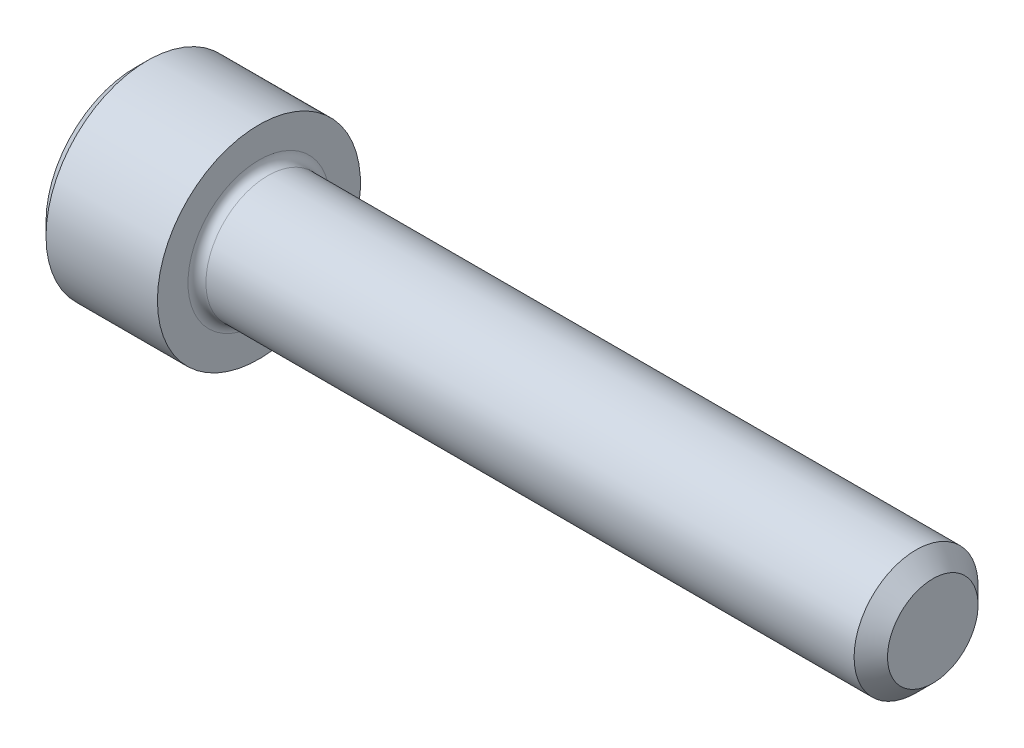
from build123d import *

# Parameters (mm, degrees)
FILLET1_R   = 0.254
HEX_2_DEPTH = 1.6256


with BuildPart() as part:
    # BodySke → Base-Revolve (revolve)
    with BuildSketch(Plane.XY, mode=Mode.PRIVATE) as base_revolve_sk:
        Polygon((0, 0), (0, 2.5146), (0.3556, 2.8702), (3.5052, 2.8702), (3.5052, 1.7526), (22.08276, 1.7526), (22.5552, 1.28016), (22.5552, 0), align=None)
    revolve(base_revolve_sk.sketch.rotate(Axis((-31.75, 0, 0), (1, 0, 0)), 90), axis=Axis((-31.75, 0, 0), (1, 0, 0)))

    # Fillet1
    fillet1_edges = [part.edges().sort_by_distance(p)[0] for p in [
        (3.5052, 0, -1.7526),
    ]]
    fillet(fillet1_edges, radius=FILLET1_R)

    # Sketch2 → Hex-PreBroach (revolve, cut)
    with BuildSketch(Plane.XY, mode=Mode.PRIVATE) as hex_prebroach_sk:
        Polygon((0, 1.3843), (1.6256, 1.3843), (2.424825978, 0), (0, 0), align=None)
    revolve(hex_prebroach_sk.sketch.rotate(Axis((0, 0, 0), (1, 0, 0)), 90), axis=Axis((0, 0, 0), (1, 0, 0)), mode=Mode.SUBTRACT)

    # Sketch3 → Hex 2 (cut)
    with BuildSketch(Plane(origin=(0, 0, 0), x_dir=(0, 0.500000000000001, 0.866025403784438), z_dir=(-1, 0, 0))):
        Polygon((0.799225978, 1.3843), (-0.799225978, 1.3843), (-1.598451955, 0), (-0.799225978, -1.3843), (0.799225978, -1.3843), (1.598451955, 0), align=None)
    extrude(amount=-HEX_2_DEPTH, mode=Mode.SUBTRACT)


solid = part.part
